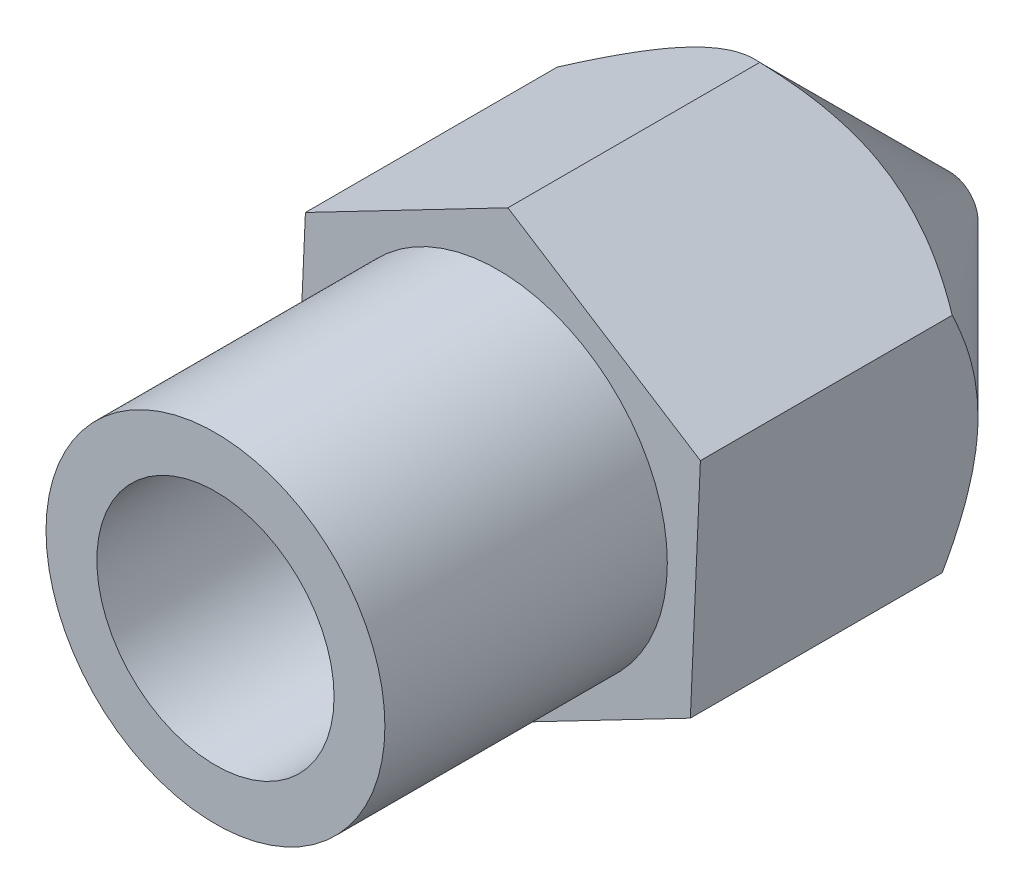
ISO-10303-21;
HEADER;
FILE_DESCRIPTION(('STEP AP214'),'2;1');
FILE_NAME('part.step','',(''),(''),'','','');
FILE_SCHEMA(('AUTOMOTIVE_DESIGN { 1 0 10303 214 1 1 1 1 }'));
ENDSEC;
DATA;
#1=APPLICATION_CONTEXT('core data for automotive mechanical design processes');
#2=APPLICATION_PROTOCOL_DEFINITION('international standard','automotive_design',2000,#1);
#3=PRODUCT_CONTEXT('',#1,'mechanical');
#4=PRODUCT('Part','Part','',(#3));
#5=PRODUCT_RELATED_PRODUCT_CATEGORY('part','',(#4));
#6=PRODUCT_DEFINITION_FORMATION('','',#4);
#7=PRODUCT_DEFINITION_CONTEXT('part definition',#1,'design');
#8=PRODUCT_DEFINITION('design','',#6,#7);
#9=PRODUCT_DEFINITION_SHAPE('','',#8);
#10=(LENGTH_UNIT() NAMED_UNIT(*) SI_UNIT(.MILLI.,.METRE.));
#11=(NAMED_UNIT(*) PLANE_ANGLE_UNIT() SI_UNIT($,.RADIAN.));
#12=(NAMED_UNIT(*) SI_UNIT($,.STERADIAN.) SOLID_ANGLE_UNIT());
#13=UNCERTAINTY_MEASURE_WITH_UNIT(LENGTH_MEASURE(1.E-05),#10,'distance_accuracy_value','');
#14=(GEOMETRIC_REPRESENTATION_CONTEXT(3) GLOBAL_UNCERTAINTY_ASSIGNED_CONTEXT((#13)) GLOBAL_UNIT_ASSIGNED_CONTEXT((#10,
#11,#12)) REPRESENTATION_CONTEXT('',''));
#15=CARTESIAN_POINT('',(0.,0.,0.));
#16=DIRECTION('',(0.,0.,1.));
#17=DIRECTION('',(1.,0.,0.));
#18=AXIS2_PLACEMENT_3D('',#15,#16,#17);
#19=CARTESIAN_POINT('',(-38.9,6.,-46.1));
#20=DIRECTION('',(0.,0.,-1.));
#21=DIRECTION('',(-1.,0.,0.));
#22=AXIS2_PLACEMENT_3D('',#19,#20,#21);
#23=PLANE('',#22);
#24=CARTESIAN_POINT('',(-38.9,6.,-46.1));
#25=DIRECTION('',(0.,0.,-1.));
#26=DIRECTION('',(-1.,0.,0.));
#27=AXIS2_PLACEMENT_3D('',#24,#25,#26);
#28=CIRCLE('',#27,0.1);
#29=CARTESIAN_POINT('',(-39.,6.,-46.1));
#30=VERTEX_POINT('',#29);
#31=EDGE_CURVE('E100',#30,#30,#28,.F.);
#32=ORIENTED_EDGE('',*,*,#31,.T.);
#33=EDGE_LOOP('',(#32));
#34=FACE_BOUND('',#33,.T.);
#35=CARTESIAN_POINT('',(-38.9,6.,-46.0999999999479));
#36=DIRECTION('',(0.,0.,1.));
#37=DIRECTION('',(1.,0.,0.));
#38=AXIS2_PLACEMENT_3D('',#35,#36,#37);
#39=CIRCLE('',#38,0.500000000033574);
#40=CARTESIAN_POINT('',(-38.3999999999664,6.,-46.0999999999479));
#41=VERTEX_POINT('',#40);
#42=EDGE_CURVE('E20',#41,#41,#39,.T.);
#43=ORIENTED_EDGE('',*,*,#42,.F.);
#44=EDGE_LOOP('',(#43));
#45=FACE_BOUND('',#44,.T.);
#46=ADVANCED_FACE('F17',(#34,#45),#23,.T.);
#47=CARTESIAN_POINT('',(-38.9,6.,-39.1));
#48=DIRECTION('',(0.,0.,-1.));
#49=DIRECTION('',(-1.,0.,0.));
#50=AXIS2_PLACEMENT_3D('',#47,#48,#49);
#51=CYLINDRICAL_SURFACE('',#50,0.1);
#52=ORIENTED_EDGE('',*,*,#31,.F.);
#53=EDGE_LOOP('',(#52));
#54=FACE_BOUND('',#53,.T.);
#55=CARTESIAN_POINT('',(-38.9,6.,-40.0999999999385));
#56=DIRECTION('',(0.,0.,1.));
#57=DIRECTION('',(0.843176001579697,-0.537637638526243,0.));
#58=AXIS2_PLACEMENT_3D('',#55,#56,#57);
#59=CIRCLE('',#58,0.0999999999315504);
#60=CARTESIAN_POINT('',(-38.9,5.89999999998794,-40.0999999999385));
#61=VERTEX_POINT('',#60);
#62=EDGE_CURVE('E99',#61,#61,#59,.T.);
#63=ORIENTED_EDGE('',*,*,#62,.T.);
#64=EDGE_LOOP('',(#63));
#65=FACE_BOUND('',#64,.T.);
#66=ADVANCED_FACE('F159',(#54,#65),#51,.F.);
#67=CARTESIAN_POINT('',(-38.9,6.,-42.5552994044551));
#68=DIRECTION('',(0.,0.,1.));
#69=DIRECTION('',(1.,0.,0.));
#70=AXIS2_PLACEMENT_3D('',#67,#68,#69);
#71=CONICAL_SURFACE('',#70,4.04470059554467,0.785398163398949);
#72=ORIENTED_EDGE('',*,*,#42,.T.);
#73=EDGE_LOOP('',(#72));
#74=FACE_BOUND('',#73,.T.);
#75=CARTESIAN_POINT('',(-38.722095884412,10.0375343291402,-42.558548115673));
#76=CARTESIAN_POINT('',(-38.8445282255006,9.97386244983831,-42.627483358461));
#77=CARTESIAN_POINT('',(-38.9689946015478,9.90913275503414,-42.6923934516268));
#78=CARTESIAN_POINT('',(-39.222841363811,9.77711779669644,-42.8113749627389));
#79=CARTESIAN_POINT('',(-39.3522481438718,9.70981880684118,-42.8653742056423));
#80=CARTESIAN_POINT('',(-39.6148017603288,9.5732757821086,-42.9586193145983));
#81=CARTESIAN_POINT('',(-39.7479342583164,9.50403920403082,-42.9979151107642));
#82=CARTESIAN_POINT('',(-40.0171178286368,9.36404822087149,-43.058412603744));
#83=CARTESIAN_POINT('',(-40.1531585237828,9.29329921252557,-43.0796702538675));
#84=CARTESIAN_POINT('',(-40.3272248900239,9.20277466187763,-43.0938709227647));
#85=CARTESIAN_POINT('',(-40.3647361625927,9.1832666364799,-43.0961667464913));
#86=CARTESIAN_POINT('',(-40.4397885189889,9.14423508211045,-43.0992314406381));
#87=CARTESIAN_POINT('',(-40.477329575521,9.12471156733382,-43.1000011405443));
#88=CARTESIAN_POINT('',(-40.6091086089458,9.05617886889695,-43.0999971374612));
#89=CARTESIAN_POINT('',(-40.7033727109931,9.00715609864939,-43.0951386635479));
#90=CARTESIAN_POINT('',(-40.8911786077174,8.90948619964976,-43.0759726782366));
#91=CARTESIAN_POINT('',(-40.9847198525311,8.86083935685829,-43.0616585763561));
#92=CARTESIAN_POINT('',(-41.17084372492,8.76404420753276,-43.0242533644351));
#93=CARTESIAN_POINT('',(-41.2634198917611,8.71589926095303,-43.0011218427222));
#94=CARTESIAN_POINT('',(-41.4467912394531,8.62053558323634,-42.9471397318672));
#95=CARTESIAN_POINT('',(-41.5375857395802,8.57331720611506,-42.9162862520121));
#96=CARTESIAN_POINT('',(-41.7446334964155,8.46564042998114,-42.8375758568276));
#97=CARTESIAN_POINT('',(-41.8601928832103,8.40554288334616,-42.7874038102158));
#98=CARTESIAN_POINT('',(-42.0304527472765,8.31699793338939,-42.7057860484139));
#99=CARTESIAN_POINT('',(-42.0864439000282,8.28787930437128,-42.6776629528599));
#100=CARTESIAN_POINT('',(-42.1976324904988,8.23005482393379,-42.6194910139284));
#101=CARTESIAN_POINT('',(-42.2528299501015,8.20134896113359,-42.5894422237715));
#102=CARTESIAN_POINT('',(-42.3076552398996,8.17283664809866,-42.5585481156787));
#103=B_SPLINE_CURVE_WITH_KNOTS('',3,(#75,#76,#77,#78,#79,#80,#81,#82,#83,#84,#85,#86,#87,#88,
#89,#90,#91,#92,#93,#94,#95,#96,#97,#98,#99,#100,#101,#102),.UNSPECIFIED.,.F.,.F.,(4,2,2,2,2,2,
2,2,2,2,2,2,2,4),(0.,0.463096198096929,0.929162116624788,1.39363068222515,1.85665317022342,
1.98366320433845,2.11060418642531,2.42920110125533,2.74802030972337,3.0683186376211,
3.38873704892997,3.80701815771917,4.01427314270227,4.22152240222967),.UNSPECIFIED.);
#104=CARTESIAN_POINT('',(-38.7220958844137,10.0375343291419,-42.5585481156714));
#105=VERTEX_POINT('',#104);
#106=CARTESIAN_POINT('',(-42.3076552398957,8.17283664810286,-42.5585481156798));
#107=VERTEX_POINT('',#106);
#108=EDGE_CURVE('E143',#105,#107,#103,.T.);
#109=ORIENTED_EDGE('',*,*,#108,.F.);
#110=CARTESIAN_POINT('',(-35.3144406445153,7.86469768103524,-42.5585481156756));
#111=CARTESIAN_POINT('',(-35.4307982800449,7.93889125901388,-42.6274833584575));
#112=CARTESIAN_POINT('',(-35.5490890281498,8.01431745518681,-42.6923934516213));
#113=CARTESIAN_POINT('',(-35.7903407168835,8.16814772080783,-42.8113749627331));
#114=CARTESIAN_POINT('',(-35.9133267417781,8.24656778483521,-42.865374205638));
#115=CARTESIAN_POINT('',(-36.1628532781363,8.4056743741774,-42.9586193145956));
#116=CARTESIAN_POINT('',(-36.2893801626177,8.48635221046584,-42.9979151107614));
#117=CARTESIAN_POINT('',(-36.5452076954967,8.64947652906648,-43.0584126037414));
#118=CARTESIAN_POINT('',(-36.6744984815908,8.73191672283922,-43.079670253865));
#119=CARTESIAN_POINT('',(-36.839928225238,8.83740034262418,-43.0938709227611));
#120=CARTESIAN_POINT('',(-36.875578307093,8.86013204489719,-43.0961667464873));
#121=CARTESIAN_POINT('',(-36.946906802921,8.90561351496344,-43.0992314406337));
#122=CARTESIAN_POINT('',(-36.9825851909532,8.92836326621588,-43.1000011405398));
#123=CARTESIAN_POINT('',(-37.1078257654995,9.00822090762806,-43.0999971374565));
#124=CARTESIAN_POINT('',(-37.1974127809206,9.06534462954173,-43.095138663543));
#125=CARTESIAN_POINT('',(-37.3759003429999,9.17915435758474,-43.0759726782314));
#126=CARTESIAN_POINT('',(-37.4648003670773,9.23584003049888,-43.0616585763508));
#127=CARTESIAN_POINT('',(-37.6416893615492,9.34863045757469,-43.0242533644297));
#128=CARTESIAN_POINT('',(-37.7296721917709,9.40473129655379,-43.0011218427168));
#129=CARTESIAN_POINT('',(-37.9039452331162,9.51585370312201,-42.9471397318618));
#130=CARTESIAN_POINT('',(-37.9902347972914,9.57087485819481,-42.9162862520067));
#131=CARTESIAN_POINT('',(-38.1870094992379,9.69634508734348,-42.8375758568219));
#132=CARTESIAN_POINT('',(-38.2968351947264,9.76637367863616,-42.7874038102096));
#133=CARTESIAN_POINT('',(-38.4586473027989,9.86955057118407,-42.705786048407));
#134=CARTESIAN_POINT('',(-38.5118603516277,9.90348101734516,-42.6776629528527));
#135=CARTESIAN_POINT('',(-38.6175321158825,9.970860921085,-42.6194910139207));
#136=CARTESIAN_POINT('',(-38.6699908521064,10.0043103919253,-42.5894422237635));
#137=CARTESIAN_POINT('',(-38.7220958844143,10.0375343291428,-42.5585481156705));
#138=B_SPLINE_CURVE_WITH_KNOTS('',3,(#110,#111,#112,#113,#114,#115,#116,#117,#118,#119,#120,
#121,#122,#123,#124,#125,#126,#127,#128,#129,#130,#131,#132,#133,#134,#135,#136,#137),
.UNSPECIFIED.,.F.,.F.,(4,2,2,2,2,2,2,2,2,2,2,2,2,4),(0.,0.463096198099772,0.929162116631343,
1.39363068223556,1.85665317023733,1.98366320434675,2.11060418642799,2.42920110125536,
2.74802030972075,3.06831863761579,3.38873704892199,3.80701815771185,4.01427314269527,
4.221522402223),.UNSPECIFIED.);
#139=CARTESIAN_POINT('',(-35.3144406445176,7.86469768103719,-42.5585481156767));
#140=VERTEX_POINT('',#139);
#141=EDGE_CURVE('E132',#140,#105,#138,.T.);
#142=ORIENTED_EDGE('',*,*,#141,.F.);
#143=CARTESIAN_POINT('',(-35.3192241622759,7.75613573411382,-42.6117712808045));
#144=CARTESIAN_POINT('',(-35.3184236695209,7.77430291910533,-42.6030510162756));
#145=CARTESIAN_POINT('',(-35.3176247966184,7.79243334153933,-42.594255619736));
#146=CARTESIAN_POINT('',(-35.3160302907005,7.82862065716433,-42.5765145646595));
#147=CARTESIAN_POINT('',(-35.3152346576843,7.8466775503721,-42.5675689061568));
#148=CARTESIAN_POINT('',(-35.3144406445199,7.86469768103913,-42.5585481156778));
#149=B_SPLINE_CURVE_WITH_KNOTS('',3,(#143,#144,#145,#146,#147,#148),.UNSPECIFIED.,.F.,.F.,(4,2,
4),(0.,0.0605011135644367,0.121002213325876),.UNSPECIFIED.);
#150=CARTESIAN_POINT('',(-35.3192243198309,7.75613568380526,-42.6117714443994));
#151=VERTEX_POINT('',#150);
#152=EDGE_CURVE('E195',#151,#140,#149,.T.);
#153=ORIENTED_EDGE('',*,*,#152,.F.);
#154=CARTESIAN_POINT('',(-35.4033927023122,5.8459305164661,-43.0999999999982));
#155=CARTESIAN_POINT('',(-35.4010269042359,5.89962230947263,-43.1000043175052));
#156=CARTESIAN_POINT('',(-35.398661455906,5.95330616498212,-43.0987614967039));
#157=CARTESIAN_POINT('',(-35.393935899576,6.06055267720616,-43.093822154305));
#158=CARTESIAN_POINT('',(-35.3915757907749,6.11411535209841,-43.0901260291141));
#159=CARTESIAN_POINT('',(-35.384518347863,6.27428403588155,-43.0754367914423));
#160=CARTESIAN_POINT('',(-35.3798347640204,6.38057798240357,-43.0608425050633));
#161=CARTESIAN_POINT('',(-35.3706076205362,6.58998802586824,-43.0231010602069));
#162=CARTESIAN_POINT('',(-35.3660630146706,6.69312786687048,-43.0000825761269));
#163=CARTESIAN_POINT('',(-35.3570605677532,6.89743842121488,-42.9464988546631));
#164=CARTESIAN_POINT('',(-35.3526027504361,6.9986085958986,-42.9159315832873));
#165=CARTESIAN_POINT('',(-35.3432647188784,7.21053524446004,-42.8443849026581));
#166=CARTESIAN_POINT('',(-35.3383964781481,7.32101997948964,-42.8026037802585));
#167=CARTESIAN_POINT('',(-35.3311649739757,7.48513898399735,-42.7348085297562));
#168=CARTESIAN_POINT('',(-35.3287562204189,7.53980565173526,-42.7112452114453));
#169=CARTESIAN_POINT('',(-35.3239682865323,7.64846782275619,-42.6626040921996));
#170=CARTESIAN_POINT('',(-35.3215891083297,7.70246327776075,-42.6375261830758));
#171=CARTESIAN_POINT('',(-35.3192241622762,7.75613573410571,-42.6117712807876));
#172=B_SPLINE_CURVE_WITH_KNOTS('',3,(#154,#155,#156,#157,#158,#159,#160,#161,#162,#163,#164,
#165,#166,#167,#168,#169,#170,#171),.UNSPECIFIED.,.F.,.F.,(4,2,2,2,2,2,2,2,4),(0.,
0.16120211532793,0.322378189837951,0.644110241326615,0.96112022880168,1.27821572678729,
1.63260005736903,1.81131449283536,1.99004170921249),.UNSPECIFIED.);
#173=CARTESIAN_POINT('',(-35.4033927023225,5.84593051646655,-43.0999999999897));
#174=VERTEX_POINT('',#173);
#175=EDGE_CURVE('E202',#174,#151,#172,.T.);
#176=ORIENTED_EDGE('',*,*,#175,.F.);
#177=CARTESIAN_POINT('',(-35.4923447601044,3.82716335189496,-42.5585481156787));
#178=CARTESIAN_POINT('',(-35.4861910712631,3.96682133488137,-42.6283790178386));
#179=CARTESIAN_POINT('',(-35.4799333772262,4.10883971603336,-42.6940844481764));
#180=CARTESIAN_POINT('',(-35.4671684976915,4.39853868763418,-42.8143217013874));
#181=CARTESIAN_POINT('',(-35.4606599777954,4.54624956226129,-42.8687797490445));
#182=CARTESIAN_POINT('',(-35.4476225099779,4.84213492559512,-42.9612619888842));
#183=CARTESIAN_POINT('',(-35.4410996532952,4.99017117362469,-42.9997178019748));
#184=CARTESIAN_POINT('',(-35.4279140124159,5.28941932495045,-43.0589672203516));
#185=CARTESIAN_POINT('',(-35.4212517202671,5.44062006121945,-43.0798147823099));
#186=CARTESIAN_POINT('',(-35.4127075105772,5.63453092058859,-43.0938642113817));
#187=CARTESIAN_POINT('',(-35.4108504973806,5.6766758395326,-43.0961570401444));
#188=CARTESIAN_POINT('',(-35.407126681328,5.76118785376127,-43.0992273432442));
#189=CARTESIAN_POINT('',(-35.405259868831,5.80355516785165,-43.0999987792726));
#190=CARTESIAN_POINT('',(-35.4033927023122,5.8459305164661,-43.0999999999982));
#191=B_SPLINE_CURVE_WITH_KNOTS('',3,(#177,#178,#179,#180,#181,#182,#183,#184,#185,#186,#187,
#188,#189,#190),.UNSPECIFIED.,.F.,.F.,(4,2,2,2,2,2,4),(0.,0.46913886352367,0.941263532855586,
1.39966676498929,1.8566601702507,1.98338469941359,2.11061118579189),.UNSPECIFIED.);
#192=CARTESIAN_POINT('',(-35.4923447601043,3.82716335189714,-42.5585481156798));
#193=VERTEX_POINT('',#192);
#194=EDGE_CURVE('E124',#193,#174,#191,.T.);
#195=ORIENTED_EDGE('',*,*,#194,.F.);
#196=CARTESIAN_POINT('',(-39.077904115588,1.96246567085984,-42.558548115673));
#197=CARTESIAN_POINT('',(-38.9554717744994,2.02613755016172,-42.627483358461));
#198=CARTESIAN_POINT('',(-38.8310053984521,2.09086724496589,-42.6923934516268));
#199=CARTESIAN_POINT('',(-38.577158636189,2.22288220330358,-42.8113749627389));
#200=CARTESIAN_POINT('',(-38.4477518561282,2.29018119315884,-42.8653742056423));
#201=CARTESIAN_POINT('',(-38.1851982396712,2.42672421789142,-42.9586193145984));
#202=CARTESIAN_POINT('',(-38.0520657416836,2.4959607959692,-42.9979151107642));
#203=CARTESIAN_POINT('',(-37.7828821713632,2.63595177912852,-43.058412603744));
#204=CARTESIAN_POINT('',(-37.6468414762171,2.70670078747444,-43.0796702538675));
#205=CARTESIAN_POINT('',(-37.4727751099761,2.79722533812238,-43.0938709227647));
#206=CARTESIAN_POINT('',(-37.4352638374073,2.81673336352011,-43.0961667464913));
#207=CARTESIAN_POINT('',(-37.3602114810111,2.85576491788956,-43.0992314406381));
#208=CARTESIAN_POINT('',(-37.322670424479,2.87528843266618,-43.1000011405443));
#209=CARTESIAN_POINT('',(-37.1908913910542,2.94382113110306,-43.0999971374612));
#210=CARTESIAN_POINT('',(-37.0966272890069,2.99284390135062,-43.0951386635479));
#211=CARTESIAN_POINT('',(-36.9088213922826,3.09051380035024,-43.0759726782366));
#212=CARTESIAN_POINT('',(-36.8152801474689,3.13916064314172,-43.0616585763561));
#213=CARTESIAN_POINT('',(-36.62915627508,3.23595579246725,-43.0242533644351));
#214=CARTESIAN_POINT('',(-36.5365801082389,3.28410073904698,-43.0011218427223));
#215=CARTESIAN_POINT('',(-36.3532087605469,3.37946441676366,-42.9471397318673));
#216=CARTESIAN_POINT('',(-36.2624142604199,3.42668279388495,-42.9162862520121));
#217=CARTESIAN_POINT('',(-36.0553665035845,3.53435957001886,-42.8375758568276));
#218=CARTESIAN_POINT('',(-35.9398071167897,3.59445711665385,-42.7874038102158));
#219=CARTESIAN_POINT('',(-35.7695472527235,3.68300206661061,-42.7057860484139));
#220=CARTESIAN_POINT('',(-35.7135560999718,3.71212069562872,-42.6776629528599));
#221=CARTESIAN_POINT('',(-35.6023675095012,3.76994517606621,-42.6194910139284));
#222=CARTESIAN_POINT('',(-35.5471700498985,3.79865103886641,-42.5894422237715));
#223=CARTESIAN_POINT('',(-35.4923447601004,3.82716335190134,-42.5585481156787));
#224=B_SPLINE_CURVE_WITH_KNOTS('',3,(#196,#197,#198,#199,#200,#201,#202,#203,#204,#205,#206,
#207,#208,#209,#210,#211,#212,#213,#214,#215,#216,#217,#218,#219,#220,#221,#222,#223),
.UNSPECIFIED.,.F.,.F.,(4,2,2,2,2,2,2,2,2,2,2,2,2,4),(0.,0.463096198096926,0.929162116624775,
1.39363068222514,1.85665317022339,1.98366320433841,2.11060418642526,2.42920110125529,
2.74802030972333,3.06831863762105,3.38873704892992,3.80701815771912,4.01427314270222,
4.22152240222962),.UNSPECIFIED.);
#225=CARTESIAN_POINT('',(-39.0779041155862,1.96246567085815,-42.5585481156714));
#226=VERTEX_POINT('',#225);
#227=EDGE_CURVE('E85',#226,#193,#224,.T.);
#228=ORIENTED_EDGE('',*,*,#227,.F.);
#229=CARTESIAN_POINT('',(-42.4855593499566,4.13530231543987,-42.5585481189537));
#230=CARTESIAN_POINT('',(-42.3692017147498,4.06110873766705,-42.627483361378));
#231=CARTESIAN_POINT('',(-42.2509109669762,3.98568254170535,-42.6923934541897));
#232=CARTESIAN_POINT('',(-42.0096592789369,3.83185227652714,-42.8113749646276));
#233=CARTESIAN_POINT('',(-41.8866732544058,3.75343221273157,-42.8653742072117));
#234=CARTESIAN_POINT('',(-41.6371467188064,3.59432562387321,-42.9586193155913));
#235=CARTESIAN_POINT('',(-41.5106198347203,3.51364778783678,-42.9979151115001));
#236=CARTESIAN_POINT('',(-41.2547923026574,3.35052346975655,-43.0584126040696));
#237=CARTESIAN_POINT('',(-41.1255015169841,3.26808327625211,-43.0796702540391));
#238=CARTESIAN_POINT('',(-40.9600717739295,3.16259965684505,-43.0938709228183));
#239=CARTESIAN_POINT('',(-40.9244216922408,3.13986795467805,-43.0961667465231));
#240=CARTESIAN_POINT('',(-40.8530931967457,3.09438648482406,-43.0992314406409));
#241=CARTESIAN_POINT('',(-40.8174148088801,3.07163673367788,-43.1000011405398));
#242=CARTESIAN_POINT('',(-40.6921742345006,2.991779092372,-43.0999971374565));
#243=CARTESIAN_POINT('',(-40.6025872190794,2.9346553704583,-43.095138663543));
#244=CARTESIAN_POINT('',(-40.424099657,2.82084564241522,-43.0759726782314));
#245=CARTESIAN_POINT('',(-40.3351996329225,2.76415996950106,-43.0616585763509));
#246=CARTESIAN_POINT('',(-40.1583106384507,2.65136954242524,-43.0242533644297));
#247=CARTESIAN_POINT('',(-40.070327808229,2.59526870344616,-43.0011218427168));
#248=CARTESIAN_POINT('',(-39.8960547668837,2.48414629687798,-42.9471397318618));
#249=CARTESIAN_POINT('',(-39.8097652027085,2.42912514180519,-42.9162862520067));
#250=CARTESIAN_POINT('',(-39.6129905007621,2.30365491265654,-42.8375758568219));
#251=CARTESIAN_POINT('',(-39.5031648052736,2.23362632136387,-42.7874038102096));
#252=CARTESIAN_POINT('',(-39.3413526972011,2.13044942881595,-42.7057860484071));
#253=CARTESIAN_POINT('',(-39.2881396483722,2.09651898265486,-42.6776629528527));
#254=CARTESIAN_POINT('',(-39.1824678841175,2.02913907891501,-42.6194910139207));
#255=CARTESIAN_POINT('',(-39.1300091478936,1.99568960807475,-42.5894422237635));
#256=CARTESIAN_POINT('',(-39.0779041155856,1.96246567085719,-42.5585481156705));
#257=B_SPLINE_CURVE_WITH_KNOTS('',3,(#229,#230,#231,#232,#233,#234,#235,#236,#237,#238,#239,
#240,#241,#242,#243,#244,#245,#246,#247,#248,#249,#250,#251,#252,#253,#254,#255,#256),
.UNSPECIFIED.,.F.,.F.,(4,2,2,2,2,2,2,2,2,2,2,2,2,4),(0.,0.463096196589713,0.929162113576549,
1.39363067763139,1.85665316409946,1.98366319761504,2.11060417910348,2.42920109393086,
2.74802030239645,3.06831863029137,3.38873704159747,3.80701815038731,4.01427313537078,
4.22152239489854),.UNSPECIFIED.);
#258=CARTESIAN_POINT('',(-42.485559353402,4.13530230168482,-42.5585481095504));
#259=VERTEX_POINT('',#258);
#260=EDGE_CURVE('E79',#259,#226,#257,.T.);
#261=ORIENTED_EDGE('',*,*,#260,.F.);
#262=CARTESIAN_POINT('',(-42.4855593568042,4.13530228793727,-42.5585481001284));
#263=CARTESIAN_POINT('',(-42.4847653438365,4.15332241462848,-42.5675688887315));
#264=CARTESIAN_POINT('',(-42.4839697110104,4.17137930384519,-42.57651454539));
#265=CARTESIAN_POINT('',(-42.4823752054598,4.20756661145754,-42.5942555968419));
#266=CARTESIAN_POINT('',(-42.4815763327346,4.22569702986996,-42.6030509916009));
#267=CARTESIAN_POINT('',(-42.4807758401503,4.24386421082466,-42.611771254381));
#268=B_SPLINE_CURVE_WITH_KNOTS('',3,(#262,#263,#264,#265,#266,#267),.UNSPECIFIED.,.F.,.F.,(4,2,
4),(0.,0.0605010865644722,0.121002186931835),.UNSPECIFIED.);
#269=CARTESIAN_POINT('',(-42.4807758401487,4.24386421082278,-42.6117712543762));
#270=VERTEX_POINT('',#269);
#271=EDGE_CURVE('E82',#259,#270,#268,.T.);
#272=ORIENTED_EDGE('',*,*,#271,.T.);
#273=CARTESIAN_POINT('',(-42.3966072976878,6.1540694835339,-43.0999999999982));
#274=CARTESIAN_POINT('',(-42.3989730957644,6.10037769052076,-43.1000043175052));
#275=CARTESIAN_POINT('',(-42.4013385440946,6.04669383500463,-43.0987614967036));
#276=CARTESIAN_POINT('',(-42.4060641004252,5.93944732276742,-43.0938221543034));
#277=CARTESIAN_POINT('',(-42.4084242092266,5.88588464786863,-43.0901260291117));
#278=CARTESIAN_POINT('',(-42.4154816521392,5.72571596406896,-43.0754367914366));
#279=CARTESIAN_POINT('',(-42.4201652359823,5.61942201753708,-43.0608425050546));
#280=CARTESIAN_POINT('',(-42.4293923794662,5.41001197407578,-43.0231010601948));
#281=CARTESIAN_POINT('',(-42.4339369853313,5.3068721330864,-43.0000825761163));
#282=CARTESIAN_POINT('',(-42.4429394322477,5.1025615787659,-42.9464988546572));
#283=CARTESIAN_POINT('',(-42.4473972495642,5.00139140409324,-42.9159315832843));
#284=CARTESIAN_POINT('',(-42.4567352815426,4.78946474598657,-42.8443848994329));
#285=CARTESIAN_POINT('',(-42.4616035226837,4.67898000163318,-42.8026037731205));
#286=CARTESIAN_POINT('',(-42.4688350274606,4.51486098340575,-42.7348085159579));
#287=CARTESIAN_POINT('',(-42.4712437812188,4.46019431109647,-42.7112451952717));
#288=CARTESIAN_POINT('',(-42.4760317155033,4.35153213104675,-42.6626040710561));
#289=CARTESIAN_POINT('',(-42.4784108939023,4.29753667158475,-42.6375261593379));
#290=CARTESIAN_POINT('',(-42.4807758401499,4.2438642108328,-42.6117712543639));
#291=B_SPLINE_CURVE_WITH_KNOTS('',3,(#273,#274,#275,#276,#277,#278,#279,#280,#281,#282,#283,
#284,#285,#286,#287,#288,#289,#290),.UNSPECIFIED.,.F.,.F.,(4,2,2,2,2,2,2,2,4),(0.,
0.161202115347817,0.322378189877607,0.64411024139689,0.961120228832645,1.27821572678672,
1.63260008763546,1.81131453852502,1.99004177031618),.UNSPECIFIED.);
#292=CARTESIAN_POINT('',(-42.3966072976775,6.15406948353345,-43.0999999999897));
#293=VERTEX_POINT('',#292);
#294=EDGE_CURVE('E98',#293,#270,#291,.T.);
#295=ORIENTED_EDGE('',*,*,#294,.F.);
#296=CARTESIAN_POINT('',(-42.3076552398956,8.17283664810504,-42.5585481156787));
#297=CARTESIAN_POINT('',(-42.3138089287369,8.03317866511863,-42.6283790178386));
#298=CARTESIAN_POINT('',(-42.3200666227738,7.89116028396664,-42.6940844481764));
#299=CARTESIAN_POINT('',(-42.3328315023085,7.60146131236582,-42.8143217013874));
#300=CARTESIAN_POINT('',(-42.3393400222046,7.45375043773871,-42.8687797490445));
#301=CARTESIAN_POINT('',(-42.3523774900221,7.15786507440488,-42.9612619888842));
#302=CARTESIAN_POINT('',(-42.3589003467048,7.00982882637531,-42.9997178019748));
#303=CARTESIAN_POINT('',(-42.3720859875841,6.71058067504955,-43.0589672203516));
#304=CARTESIAN_POINT('',(-42.3787482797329,6.55937993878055,-43.0798147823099));
#305=CARTESIAN_POINT('',(-42.3872924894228,6.36546907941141,-43.0938642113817));
#306=CARTESIAN_POINT('',(-42.3891495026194,6.32332416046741,-43.0961570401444));
#307=CARTESIAN_POINT('',(-42.392873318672,6.23881214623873,-43.0992273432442));
#308=CARTESIAN_POINT('',(-42.394740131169,6.19644483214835,-43.0999987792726));
#309=CARTESIAN_POINT('',(-42.3966072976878,6.1540694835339,-43.0999999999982));
#310=B_SPLINE_CURVE_WITH_KNOTS('',3,(#296,#297,#298,#299,#300,#301,#302,#303,#304,#305,#306,
#307,#308,#309),.UNSPECIFIED.,.F.,.F.,(4,2,2,2,2,2,4),(0.,0.469138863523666,0.941263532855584,
1.39966676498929,1.85666017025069,1.98338469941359,2.11061118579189),.UNSPECIFIED.);
#311=EDGE_CURVE('E105',#107,#293,#310,.T.);
#312=ORIENTED_EDGE('',*,*,#311,.F.);
#313=EDGE_LOOP('',(#109,#142,#153,#176,#195,#228,#261,#272,#295,#312));
#314=FACE_BOUND('',#313,.T.);
#315=ADVANCED_FACE('F81',(#74,#314),#71,.T.);
#316=CARTESIAN_POINT('',(-38.9,6.,-38.0999999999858));
#317=DIRECTION('',(0.,0.,1.));
#318=DIRECTION('',(0.,-1.,0.));
#319=AXIS2_PLACEMENT_3D('',#316,#317,#318);
#320=CONICAL_SURFACE('',#319,2.09999999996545,0.785398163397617);
#321=CARTESIAN_POINT('',(-38.9,6.,-38.1));
#322=DIRECTION('',(0.,0.,1.));
#323=DIRECTION('',(1.,0.,0.));
#324=AXIS2_PLACEMENT_3D('',#321,#322,#323);
#325=CIRCLE('',#324,2.1);
#326=CARTESIAN_POINT('',(-38.9,3.90000000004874,-38.1));
#327=VERTEX_POINT('',#326);
#328=EDGE_CURVE('E141',#327,#327,#325,.T.);
#329=CARTESIAN_POINT('',(-38.9,5.89999999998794,-40.0999999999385));
#330=CARTESIAN_POINT('',(-38.9,5.87916666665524,-40.0791666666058));
#331=CARTESIAN_POINT('',(-38.9,5.85833333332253,-40.0583333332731));
#332=CARTESIAN_POINT('',(-38.9,5.81666666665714,-40.0166666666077));
#333=CARTESIAN_POINT('',(-38.9,5.79583333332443,-39.9958333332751));
#334=CARTESIAN_POINT('',(-38.9,5.75416666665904,-39.9541666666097));
#335=CARTESIAN_POINT('',(-38.9,5.73333333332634,-39.933333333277));
#336=CARTESIAN_POINT('',(-38.9,5.69166666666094,-39.8916666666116));
#337=CARTESIAN_POINT('',(-38.9,5.67083333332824,-39.8708333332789));
#338=CARTESIAN_POINT('',(-38.9,5.62916666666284,-39.8291666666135));
#339=CARTESIAN_POINT('',(-38.9,5.60833333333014,-39.8083333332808));
#340=CARTESIAN_POINT('',(-38.9,5.56666666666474,-39.7666666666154));
#341=CARTESIAN_POINT('',(-38.9,5.54583333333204,-39.7458333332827));
#342=CARTESIAN_POINT('',(-38.9,5.50416666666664,-39.7041666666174));
#343=CARTESIAN_POINT('',(-38.9,5.48333333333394,-39.6833333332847));
#344=CARTESIAN_POINT('',(-38.9,5.44166666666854,-39.6416666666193));
#345=CARTESIAN_POINT('',(-38.9,5.42083333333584,-39.6208333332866));
#346=CARTESIAN_POINT('',(-38.9,5.37916666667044,-39.5791666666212));
#347=CARTESIAN_POINT('',(-38.9,5.35833333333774,-39.5583333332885));
#348=CARTESIAN_POINT('',(-38.9,5.31666666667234,-39.5166666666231));
#349=CARTESIAN_POINT('',(-38.9,5.29583333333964,-39.4958333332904));
#350=CARTESIAN_POINT('',(-38.9,5.25416666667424,-39.454166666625));
#351=CARTESIAN_POINT('',(-38.9,5.23333333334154,-39.4333333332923));
#352=CARTESIAN_POINT('',(-38.9,5.19166666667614,-39.391666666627));
#353=CARTESIAN_POINT('',(-38.9,5.17083333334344,-39.3708333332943));
#354=CARTESIAN_POINT('',(-38.9,5.12916666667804,-39.3291666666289));
#355=CARTESIAN_POINT('',(-38.9,5.10833333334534,-39.3083333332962));
#356=CARTESIAN_POINT('',(-38.9,5.06666666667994,-39.2666666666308));
#357=CARTESIAN_POINT('',(-38.9,5.04583333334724,-39.2458333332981));
#358=CARTESIAN_POINT('',(-38.9,5.00416666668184,-39.2041666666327));
#359=CARTESIAN_POINT('',(-38.9,4.98333333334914,-39.1833333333));
#360=CARTESIAN_POINT('',(-38.9,4.94166666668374,-39.1416666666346));
#361=CARTESIAN_POINT('',(-38.9,4.92083333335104,-39.120833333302));
#362=CARTESIAN_POINT('',(-38.9,4.87916666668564,-39.0791666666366));
#363=CARTESIAN_POINT('',(-38.9,4.85833333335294,-39.0583333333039));
#364=CARTESIAN_POINT('',(-38.9,4.81666666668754,-39.0166666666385));
#365=CARTESIAN_POINT('',(-38.9,4.79583333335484,-38.9958333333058));
#366=CARTESIAN_POINT('',(-38.9,4.75416666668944,-38.9541666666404));
#367=CARTESIAN_POINT('',(-38.9,4.73333333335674,-38.9333333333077));
#368=CARTESIAN_POINT('',(-38.9,4.69166666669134,-38.8916666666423));
#369=CARTESIAN_POINT('',(-38.9,4.67083333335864,-38.8708333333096));
#370=CARTESIAN_POINT('',(-38.9,4.62916666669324,-38.8291666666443));
#371=CARTESIAN_POINT('',(-38.9,4.60833333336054,-38.8083333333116));
#372=CARTESIAN_POINT('',(-38.9,4.56666666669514,-38.7666666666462));
#373=CARTESIAN_POINT('',(-38.9,4.54583333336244,-38.7458333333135));
#374=CARTESIAN_POINT('',(-38.9,4.50416666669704,-38.7041666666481));
#375=CARTESIAN_POINT('',(-38.9,4.48333333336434,-38.6833333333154));
#376=CARTESIAN_POINT('',(-38.9,4.44166666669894,-38.64166666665));
#377=CARTESIAN_POINT('',(-38.9,4.42083333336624,-38.6208333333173));
#378=CARTESIAN_POINT('',(-38.9,4.37916666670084,-38.5791666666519));
#379=CARTESIAN_POINT('',(-38.9,4.35833333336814,-38.5583333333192));
#380=CARTESIAN_POINT('',(-38.9,4.31666666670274,-38.5166666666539));
#381=CARTESIAN_POINT('',(-38.9,4.29583333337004,-38.4958333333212));
#382=CARTESIAN_POINT('',(-38.9,4.25416666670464,-38.4541666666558));
#383=CARTESIAN_POINT('',(-38.9,4.23333333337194,-38.4333333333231));
#384=CARTESIAN_POINT('',(-38.9,4.19166666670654,-38.3916666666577));
#385=CARTESIAN_POINT('',(-38.9,4.17083333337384,-38.370833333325));
#386=CARTESIAN_POINT('',(-38.9,4.12916666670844,-38.3291666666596));
#387=CARTESIAN_POINT('',(-38.9,4.10833333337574,-38.3083333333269));
#388=CARTESIAN_POINT('',(-38.9,4.06666666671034,-38.2666666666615));
#389=CARTESIAN_POINT('',(-38.9,4.04583333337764,-38.2458333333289));
#390=CARTESIAN_POINT('',(-38.9,4.00416666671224,-38.2041666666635));
#391=CARTESIAN_POINT('',(-38.9,3.98333333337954,-38.1833333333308));
#392=CARTESIAN_POINT('',(-38.9,3.94166666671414,-38.1416666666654));
#393=CARTESIAN_POINT('',(-38.9,3.92083333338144,-38.1208333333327));
#394=CARTESIAN_POINT('',(-38.9,3.90000000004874,-38.1));
#395=B_SPLINE_CURVE_WITH_KNOTS('',3,(#329,#330,#331,#332,#333,#334,#335,#336,#337,#338,#339,
#340,#341,#342,#343,#344,#345,#346,#347,#348,#349,#350,#351,#352,#353,#354,#355,#356,#357,#358,
#359,#360,#361,#362,#363,#364,#365,#366,#367,#368,#369,#370,#371,#372,#373,#374,#375,#376,#377,
#378,#379,#380,#381,#382,#383,#384,#385,#386,#387,#388,#389,#390,#391,#392,#393,#394),
.UNSPECIFIED.,.F.,.F.,(4,2,2,2,2,2,2,2,2,2,2,2,2,2,2,2,2,2,2,2,2,2,2,2,2,2,2,2,2,2,2,2,4),(0.,
0.0883883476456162,0.176776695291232,0.265165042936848,0.353553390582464,0.441941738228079,
0.530330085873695,0.618718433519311,0.707106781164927,0.795495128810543,0.883883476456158,
0.972271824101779,1.06066017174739,1.14904851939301,1.23743686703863,1.32582521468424,
1.41421356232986,1.50260190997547,1.59099025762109,1.67937860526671,1.76776695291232,
1.85615530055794,1.94454364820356,2.03293199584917,2.12132034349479,2.2097086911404,
2.29809703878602,2.38648538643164,2.47487373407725,2.56326208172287,2.65165042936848,
2.7400387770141,2.82842712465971),.UNSPECIFIED.);
#396=EDGE_CURVE('BSEAM158',#61,#327,#395,.T.);
#397=ORIENTED_EDGE('',*,*,#62,.F.);
#398=ORIENTED_EDGE('',*,*,#328,.T.);
#399=ORIENTED_EDGE('',*,*,#396,.T.);
#400=ORIENTED_EDGE('',*,*,#396,.F.);
#401=EDGE_LOOP('',(#397,#399,#398,#400));
#402=FACE_BOUND('',#401,.T.);
#403=ADVANCED_FACE('F158',(#402),#320,.F.);
#404=CARTESIAN_POINT('',(-35.3144406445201,7.86469768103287,-38.1));
#405=DIRECTION('',(0.999030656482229,-0.0440198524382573,0.));
#406=DIRECTION('',(0.0440198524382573,0.999030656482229,0.));
#407=AXIS2_PLACEMENT_3D('',#404,#405,#406);
#408=PLANE('',#407);
#409=ORIENTED_EDGE('',*,*,#175,.T.);
#410=ORIENTED_EDGE('',*,*,#152,.T.);
#411=DIRECTION('',(0.,0.,1.));
#412=VECTOR('',#411,1.);
#413=CARTESIAN_POINT('',(-35.3144406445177,7.86469768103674,-38.1));
#414=LINE('',#413,#412);
#415=CARTESIAN_POINT('',(-35.3144406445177,7.86469768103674,-38.1));
#416=VERTEX_POINT('',#415);
#417=EDGE_CURVE('E142',#416,#140,#414,.F.);
#418=ORIENTED_EDGE('',*,*,#417,.F.);
#419=DIRECTION('',(-0.0440198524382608,-0.999030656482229,0.));
#420=VECTOR('',#419,1.);
#421=CARTESIAN_POINT('',(-35.3144406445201,7.86469768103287,-38.1));
#422=LINE('',#421,#420);
#423=CARTESIAN_POINT('',(-35.4923447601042,3.82716335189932,-38.1));
#424=VERTEX_POINT('',#423);
#425=EDGE_CURVE('E120',#416,#424,#422,.T.);
#426=ORIENTED_EDGE('',*,*,#425,.T.);
#427=DIRECTION('',(0.,0.,1.));
#428=VECTOR('',#427,1.);
#429=CARTESIAN_POINT('',(-35.4923447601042,3.82716335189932,-38.1));
#430=LINE('',#429,#428);
#431=EDGE_CURVE('E292',#193,#424,#430,.T.);
#432=ORIENTED_EDGE('',*,*,#431,.F.);
#433=ORIENTED_EDGE('',*,*,#194,.T.);
#434=EDGE_LOOP('',(#409,#410,#418,#426,#432,#433));
#435=FACE_BOUND('',#434,.T.);
#436=ADVANCED_FACE('F188',(#435),#408,.T.);
#437=CARTESIAN_POINT('',(-35.4923447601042,3.82716335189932,-38.1));
#438=DIRECTION('',(0.461393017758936,-0.887195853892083,0.));
#439=DIRECTION('',(0.887195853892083,0.461393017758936,0.));
#440=AXIS2_PLACEMENT_3D('',#437,#438,#439);
#441=PLANE('',#440);
#442=DIRECTION('',(0.,0.,1.));
#443=VECTOR('',#442,1.);
#444=CARTESIAN_POINT('',(-39.0779041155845,1.96246567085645,-38.1));
#445=LINE('',#444,#443);
#446=CARTESIAN_POINT('',(-39.0779041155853,1.96246567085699,-38.1));
#447=VERTEX_POINT('',#446);
#448=EDGE_CURVE('E91',#226,#447,#445,.T.);
#449=ORIENTED_EDGE('',*,*,#448,.F.);
#450=ORIENTED_EDGE('',*,*,#227,.T.);
#451=ORIENTED_EDGE('',*,*,#431,.T.);
#452=DIRECTION('',(-0.887195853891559,-0.461393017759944,0.));
#453=VECTOR('',#452,1.);
#454=CARTESIAN_POINT('',(-35.4923447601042,3.82716335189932,-38.1));
#455=LINE('',#454,#453);
#456=EDGE_CURVE('E116',#424,#447,#455,.T.);
#457=ORIENTED_EDGE('',*,*,#456,.T.);
#458=EDGE_LOOP('',(#449,#450,#451,#457));
#459=FACE_BOUND('',#458,.T.);
#460=ADVANCED_FACE('F184',(#459),#441,.T.);
#461=CARTESIAN_POINT('',(-39.0779041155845,1.96246567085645,-38.1));
#462=DIRECTION('',(-0.537637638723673,-0.843176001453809,0.));
#463=DIRECTION('',(0.843176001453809,-0.537637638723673,0.));
#464=AXIS2_PLACEMENT_3D('',#461,#462,#463);
#465=PLANE('',#464);
#466=DIRECTION('',(0.,0.,1.));
#467=VECTOR('',#466,1.);
#468=CARTESIAN_POINT('',(-42.4855593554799,4.13530231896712,-38.1));
#469=LINE('',#468,#467);
#470=CARTESIAN_POINT('',(-42.4855593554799,4.13530231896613,-38.1));
#471=VERTEX_POINT('',#470);
#472=EDGE_CURVE('E90',#259,#471,#469,.T.);
#473=ORIENTED_EDGE('',*,*,#472,.F.);
#474=ORIENTED_EDGE('',*,*,#260,.T.);
#475=ORIENTED_EDGE('',*,*,#448,.T.);
#476=DIRECTION('',(-0.843176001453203,0.537637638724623,0.));
#477=VECTOR('',#476,1.);
#478=CARTESIAN_POINT('',(-39.0779041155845,1.96246567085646,-38.1));
#479=LINE('',#478,#477);
#480=EDGE_CURVE('E104',#447,#471,#479,.T.);
#481=ORIENTED_EDGE('',*,*,#480,.T.);
#482=EDGE_LOOP('',(#473,#474,#475,#481));
#483=FACE_BOUND('',#482,.T.);
#484=ADVANCED_FACE('F102',(#483),#465,.T.);
#485=CARTESIAN_POINT('',(-42.4855593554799,4.13530231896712,-38.1));
#486=DIRECTION('',(-0.999030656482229,0.0440198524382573,0.));
#487=DIRECTION('',(-0.0440198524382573,-0.999030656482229,0.));
#488=AXIS2_PLACEMENT_3D('',#485,#486,#487);
#489=PLANE('',#488);
#490=ORIENTED_EDGE('',*,*,#294,.T.);
#491=ORIENTED_EDGE('',*,*,#271,.F.);
#492=ORIENTED_EDGE('',*,*,#472,.T.);
#493=DIRECTION('',(0.044019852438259,0.999030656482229,0.));
#494=VECTOR('',#493,1.);
#495=CARTESIAN_POINT('',(-42.4855593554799,4.13530231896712,-38.1));
#496=LINE('',#495,#494);
#497=CARTESIAN_POINT('',(-42.3076552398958,8.17283664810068,-38.1));
#498=VERTEX_POINT('',#497);
#499=EDGE_CURVE('E115',#471,#498,#496,.T.);
#500=ORIENTED_EDGE('',*,*,#499,.T.);
#501=DIRECTION('',(0.,0.,1.));
#502=VECTOR('',#501,1.);
#503=CARTESIAN_POINT('',(-42.3076552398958,8.17283664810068,-38.1));
#504=LINE('',#503,#502);
#505=EDGE_CURVE('E268',#107,#498,#504,.T.);
#506=ORIENTED_EDGE('',*,*,#505,.F.);
#507=ORIENTED_EDGE('',*,*,#311,.T.);
#508=EDGE_LOOP('',(#490,#491,#492,#500,#506,#507));
#509=FACE_BOUND('',#508,.T.);
#510=ADVANCED_FACE('F95',(#509),#489,.T.);
#511=CARTESIAN_POINT('',(-42.3076552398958,8.17283664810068,-38.1));
#512=DIRECTION('',(-0.461393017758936,0.887195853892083,0.));
#513=DIRECTION('',(-0.887195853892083,-0.461393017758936,0.));
#514=AXIS2_PLACEMENT_3D('',#511,#512,#513);
#515=PLANE('',#514);
#516=DIRECTION('',(0.,0.,1.));
#517=VECTOR('',#516,1.);
#518=CARTESIAN_POINT('',(-38.7220958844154,10.0375343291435,-38.1));
#519=LINE('',#518,#517);
#520=CARTESIAN_POINT('',(-38.7220958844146,10.037534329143,-38.1));
#521=VERTEX_POINT('',#520);
#522=EDGE_CURVE('E277',#105,#521,#519,.T.);
#523=ORIENTED_EDGE('',*,*,#522,.F.);
#524=ORIENTED_EDGE('',*,*,#108,.T.);
#525=ORIENTED_EDGE('',*,*,#505,.T.);
#526=DIRECTION('',(0.887195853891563,0.461393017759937,0.));
#527=VECTOR('',#526,1.);
#528=CARTESIAN_POINT('',(-42.3076552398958,8.17283664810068,-38.1));
#529=LINE('',#528,#527);
#530=EDGE_CURVE('E35',#498,#521,#529,.T.);
#531=ORIENTED_EDGE('',*,*,#530,.T.);
#532=EDGE_LOOP('',(#523,#524,#525,#531));
#533=FACE_BOUND('',#532,.T.);
#534=ADVANCED_FACE('F246',(#533),#515,.T.);
#535=CARTESIAN_POINT('',(-38.7220958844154,10.0375343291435,-38.1));
#536=DIRECTION('',(0.537637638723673,0.843176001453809,0.));
#537=DIRECTION('',(-0.843176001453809,0.537637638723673,0.));
#538=AXIS2_PLACEMENT_3D('',#535,#536,#537);
#539=PLANE('',#538);
#540=ORIENTED_EDGE('',*,*,#417,.T.);
#541=ORIENTED_EDGE('',*,*,#141,.T.);
#542=ORIENTED_EDGE('',*,*,#522,.T.);
#543=DIRECTION('',(0.843176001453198,-0.537637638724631,0.));
#544=VECTOR('',#543,1.);
#545=CARTESIAN_POINT('',(-38.7220958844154,10.0375343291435,-38.1));
#546=LINE('',#545,#544);
#547=EDGE_CURVE('E131',#521,#416,#546,.T.);
#548=ORIENTED_EDGE('',*,*,#547,.T.);
#549=EDGE_LOOP('',(#540,#541,#542,#548));
#550=FACE_BOUND('',#549,.T.);
#551=ADVANCED_FACE('F151',(#550),#539,.T.);
#552=CARTESIAN_POINT('',(-38.9,6.,-35.6));
#553=DIRECTION('',(0.,0.,1.));
#554=DIRECTION('',(1.,0.,0.));
#555=AXIS2_PLACEMENT_3D('',#552,#553,#554);
#556=CYLINDRICAL_SURFACE('',#555,2.1);
#557=CARTESIAN_POINT('',(-38.9,6.,-33.1));
#558=DIRECTION('',(0.,0.,1.));
#559=DIRECTION('',(1.,0.,0.));
#560=AXIS2_PLACEMENT_3D('',#557,#558,#559);
#561=CIRCLE('',#560,2.1);
#562=CARTESIAN_POINT('',(-36.8,6.,-33.1));
#563=VERTEX_POINT('',#562);
#564=EDGE_CURVE('E128',#563,#563,#561,.F.);
#565=ORIENTED_EDGE('',*,*,#564,.F.);
#566=EDGE_LOOP('',(#565));
#567=FACE_BOUND('',#566,.T.);
#568=ORIENTED_EDGE('',*,*,#328,.F.);
#569=EDGE_LOOP('',(#568));
#570=FACE_BOUND('',#569,.T.);
#571=ADVANCED_FACE('F239',(#567,#570),#556,.F.);
#572=CARTESIAN_POINT('',(-38.9,6.,-38.1));
#573=DIRECTION('',(0.,0.,-1.));
#574=DIRECTION('',(-1.,0.,0.));
#575=AXIS2_PLACEMENT_3D('',#572,#573,#574);
#576=PLANE('',#575);
#577=CARTESIAN_POINT('',(-38.9,6.,-38.1));
#578=DIRECTION('',(0.,0.,1.));
#579=DIRECTION('',(1.,0.,0.));
#580=AXIS2_PLACEMENT_3D('',#577,#578,#579);
#581=CIRCLE('',#580,3.);
#582=CARTESIAN_POINT('',(-35.9,6.,-38.1));
#583=VERTEX_POINT('',#582);
#584=EDGE_CURVE('E26',#583,#583,#581,.T.);
#585=ORIENTED_EDGE('',*,*,#584,.F.);
#586=EDGE_LOOP('',(#585));
#587=FACE_BOUND('',#586,.T.);
#588=ORIENTED_EDGE('',*,*,#530,.F.);
#589=ORIENTED_EDGE('',*,*,#499,.F.);
#590=ORIENTED_EDGE('',*,*,#480,.F.);
#591=ORIENTED_EDGE('',*,*,#456,.F.);
#592=ORIENTED_EDGE('',*,*,#425,.F.);
#593=ORIENTED_EDGE('',*,*,#547,.F.);
#594=EDGE_LOOP('',(#588,#589,#590,#591,#592,#593));
#595=FACE_BOUND('',#594,.T.);
#596=ADVANCED_FACE('F233',(#587,#595),#576,.F.);
#597=CARTESIAN_POINT('',(-38.9,6.,-33.1));
#598=DIRECTION('',(0.,0.,1.));
#599=DIRECTION('',(1.,0.,0.));
#600=AXIS2_PLACEMENT_3D('',#597,#598,#599);
#601=PLANE('',#600);
#602=ORIENTED_EDGE('',*,*,#564,.T.);
#603=EDGE_LOOP('',(#602));
#604=FACE_BOUND('',#603,.T.);
#605=CARTESIAN_POINT('',(-38.9,6.,-33.1));
#606=DIRECTION('',(0.,0.,1.));
#607=DIRECTION('',(1.,0.,0.));
#608=AXIS2_PLACEMENT_3D('',#605,#606,#607);
#609=CIRCLE('',#608,3.);
#610=CARTESIAN_POINT('',(-35.9,6.,-33.1));
#611=VERTEX_POINT('',#610);
#612=EDGE_CURVE('E11',#611,#611,#609,.F.);
#613=ORIENTED_EDGE('',*,*,#612,.F.);
#614=EDGE_LOOP('',(#613));
#615=FACE_BOUND('',#614,.T.);
#616=ADVANCED_FACE('F227',(#604,#615),#601,.T.);
#617=CARTESIAN_POINT('',(-38.9,6.,-35.6));
#618=DIRECTION('',(0.,0.,1.));
#619=DIRECTION('',(1.,0.,0.));
#620=AXIS2_PLACEMENT_3D('',#617,#618,#619);
#621=CYLINDRICAL_SURFACE('',#620,3.);
#622=ORIENTED_EDGE('',*,*,#584,.T.);
#623=EDGE_LOOP('',(#622));
#624=FACE_BOUND('',#623,.T.);
#625=ORIENTED_EDGE('',*,*,#612,.T.);
#626=EDGE_LOOP('',(#625));
#627=FACE_BOUND('',#626,.T.);
#628=ADVANCED_FACE('F225',(#624,#627),#621,.T.);
#629=CLOSED_SHELL('',(#46,#66,#315,#403,#436,#460,#484,#510,#534,#551,#571,#596,#616,#628));
#630=MANIFOLD_SOLID_BREP('B1',#629);
#631=ADVANCED_BREP_SHAPE_REPRESENTATION('',(#18,#630),#14);
#632=SHAPE_DEFINITION_REPRESENTATION(#9,#631);
ENDSEC;
END-ISO-10303-21;
